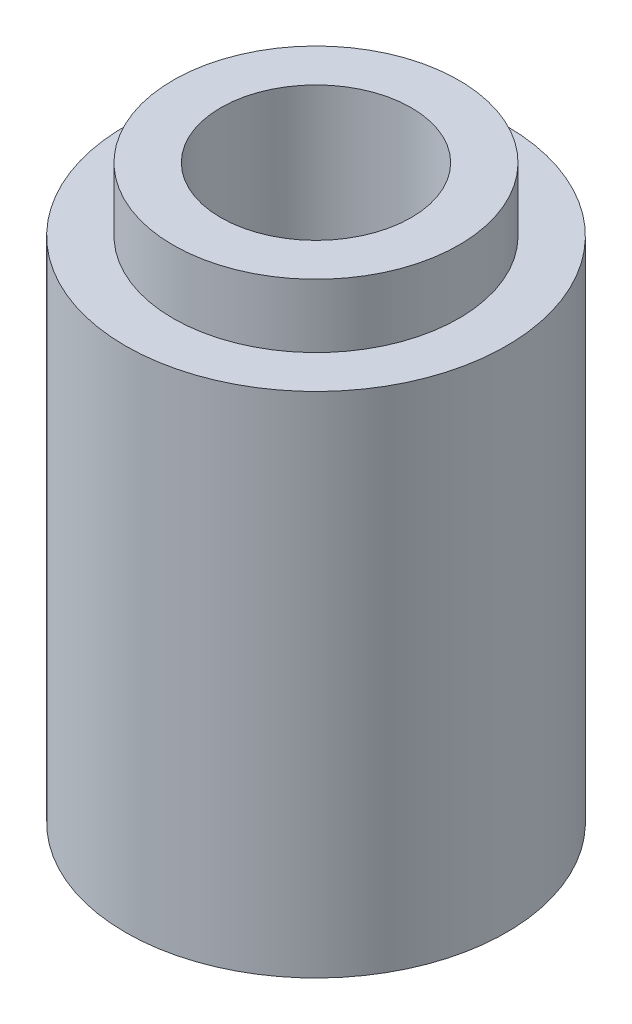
ISO-10303-21;
HEADER;
FILE_DESCRIPTION(('STEP AP214'),'2;1');
FILE_NAME('part.step','',(''),(''),'','','');
FILE_SCHEMA(('AUTOMOTIVE_DESIGN { 1 0 10303 214 1 1 1 1 }'));
ENDSEC;
DATA;
#1=APPLICATION_CONTEXT('core data for automotive mechanical design processes');
#2=APPLICATION_PROTOCOL_DEFINITION('international standard','automotive_design',2000,#1);
#3=PRODUCT_CONTEXT('',#1,'mechanical');
#4=PRODUCT('Part','Part','',(#3));
#5=PRODUCT_RELATED_PRODUCT_CATEGORY('part','',(#4));
#6=PRODUCT_DEFINITION_FORMATION('','',#4);
#7=PRODUCT_DEFINITION_CONTEXT('part definition',#1,'design');
#8=PRODUCT_DEFINITION('design','',#6,#7);
#9=PRODUCT_DEFINITION_SHAPE('','',#8);
#10=(LENGTH_UNIT() NAMED_UNIT(*) SI_UNIT(.MILLI.,.METRE.));
#11=(NAMED_UNIT(*) PLANE_ANGLE_UNIT() SI_UNIT($,.RADIAN.));
#12=(NAMED_UNIT(*) SI_UNIT($,.STERADIAN.) SOLID_ANGLE_UNIT());
#13=UNCERTAINTY_MEASURE_WITH_UNIT(LENGTH_MEASURE(1.E-05),#10,'distance_accuracy_value','');
#14=(GEOMETRIC_REPRESENTATION_CONTEXT(3) GLOBAL_UNCERTAINTY_ASSIGNED_CONTEXT((#13)) GLOBAL_UNIT_ASSIGNED_CONTEXT((#10,
#11,#12)) REPRESENTATION_CONTEXT('',''));
#15=CARTESIAN_POINT('',(0.,0.,0.));
#16=DIRECTION('',(0.,0.,1.));
#17=DIRECTION('',(1.,0.,0.));
#18=AXIS2_PLACEMENT_3D('',#15,#16,#17);
#19=CARTESIAN_POINT('',(0.,8.,0.));
#20=DIRECTION('',(0.,1.,0.));
#21=DIRECTION('',(0.,0.,1.));
#22=AXIS2_PLACEMENT_3D('',#19,#20,#21);
#23=PLANE('',#22);
#24=CARTESIAN_POINT('',(0.,8.,0.));
#25=DIRECTION('',(0.,1.,0.));
#26=DIRECTION('',(0.,0.,1.));
#27=AXIS2_PLACEMENT_3D('',#24,#25,#26);
#28=CIRCLE('',#27,3.);
#29=CARTESIAN_POINT('',(0.,8.,3.));
#30=VERTEX_POINT('',#29);
#31=EDGE_CURVE('E10',#30,#30,#28,.T.);
#32=ORIENTED_EDGE('',*,*,#31,.T.);
#33=EDGE_LOOP('',(#32));
#34=FACE_BOUND('',#33,.T.);
#35=CARTESIAN_POINT('',(0.,8.,0.));
#36=DIRECTION('',(0.,1.,0.));
#37=DIRECTION('',(0.,0.,1.));
#38=AXIS2_PLACEMENT_3D('',#35,#36,#37);
#39=CIRCLE('',#38,2.25);
#40=CARTESIAN_POINT('',(0.,8.,2.25));
#41=VERTEX_POINT('',#40);
#42=EDGE_CURVE('E42',#41,#41,#39,.T.);
#43=ORIENTED_EDGE('',*,*,#42,.F.);
#44=EDGE_LOOP('',(#43));
#45=FACE_BOUND('',#44,.T.);
#46=ADVANCED_FACE('F29',(#34,#45),#23,.T.);
#47=CARTESIAN_POINT('',(0.,8.,0.));
#48=DIRECTION('',(0.,-1.,0.));
#49=DIRECTION('',(0.,0.,-1.));
#50=AXIS2_PLACEMENT_3D('',#47,#48,#49);
#51=CYLINDRICAL_SURFACE('',#50,3.);
#52=ORIENTED_EDGE('',*,*,#31,.F.);
#53=EDGE_LOOP('',(#52));
#54=FACE_BOUND('',#53,.T.);
#55=CARTESIAN_POINT('',(0.,0.,0.));
#56=DIRECTION('',(0.,1.,0.));
#57=DIRECTION('',(0.,0.,1.));
#58=AXIS2_PLACEMENT_3D('',#55,#56,#57);
#59=CIRCLE('',#58,3.);
#60=CARTESIAN_POINT('',(0.,0.,3.));
#61=VERTEX_POINT('',#60);
#62=EDGE_CURVE('E33',#61,#61,#59,.T.);
#63=ORIENTED_EDGE('',*,*,#62,.T.);
#64=EDGE_LOOP('',(#63));
#65=FACE_BOUND('',#64,.T.);
#66=ADVANCED_FACE('F31',(#54,#65),#51,.T.);
#67=CARTESIAN_POINT('',(0.,0.,0.));
#68=DIRECTION('',(0.,1.,0.));
#69=DIRECTION('',(0.,0.,1.));
#70=AXIS2_PLACEMENT_3D('',#67,#68,#69);
#71=PLANE('',#70);
#72=CARTESIAN_POINT('',(0.,0.,0.));
#73=DIRECTION('',(0.,-1.,0.));
#74=DIRECTION('',(0.,0.,-1.));
#75=AXIS2_PLACEMENT_3D('',#72,#73,#74);
#76=CIRCLE('',#75,1.5);
#77=CARTESIAN_POINT('',(0.,0.,-1.5));
#78=VERTEX_POINT('',#77);
#79=EDGE_CURVE('E50',#78,#78,#76,.T.);
#80=ORIENTED_EDGE('',*,*,#79,.F.);
#81=EDGE_LOOP('',(#80));
#82=FACE_BOUND('',#81,.T.);
#83=ORIENTED_EDGE('',*,*,#62,.F.);
#84=EDGE_LOOP('',(#83));
#85=FACE_BOUND('',#84,.T.);
#86=ADVANCED_FACE('F57',(#82,#85),#71,.F.);
#87=CARTESIAN_POINT('',(0.,9.,0.));
#88=DIRECTION('',(0.,-1.,0.));
#89=DIRECTION('',(0.,0.,-1.));
#90=AXIS2_PLACEMENT_3D('',#87,#88,#89);
#91=CYLINDRICAL_SURFACE('',#90,2.25);
#92=CARTESIAN_POINT('',(0.,9.,0.));
#93=DIRECTION('',(0.,1.,0.));
#94=DIRECTION('',(0.,0.,1.));
#95=AXIS2_PLACEMENT_3D('',#92,#93,#94);
#96=CIRCLE('',#95,2.25);
#97=CARTESIAN_POINT('',(0.,9.,2.25));
#98=VERTEX_POINT('',#97);
#99=EDGE_CURVE('E40',#98,#98,#96,.T.);
#100=ORIENTED_EDGE('',*,*,#99,.F.);
#101=EDGE_LOOP('',(#100));
#102=FACE_BOUND('',#101,.T.);
#103=ORIENTED_EDGE('',*,*,#42,.T.);
#104=EDGE_LOOP('',(#103));
#105=FACE_BOUND('',#104,.T.);
#106=ADVANCED_FACE('F60',(#102,#105),#91,.T.);
#107=CARTESIAN_POINT('',(0.,9.,0.));
#108=DIRECTION('',(0.,1.,0.));
#109=DIRECTION('',(0.,0.,1.));
#110=AXIS2_PLACEMENT_3D('',#107,#108,#109);
#111=PLANE('',#110);
#112=CARTESIAN_POINT('',(0.,9.,0.));
#113=DIRECTION('',(0.,1.,0.));
#114=DIRECTION('',(0.,0.,1.));
#115=AXIS2_PLACEMENT_3D('',#112,#113,#114);
#116=CIRCLE('',#115,1.5);
#117=CARTESIAN_POINT('',(0.,9.,1.5));
#118=VERTEX_POINT('',#117);
#119=EDGE_CURVE('E45',#118,#118,#116,.F.);
#120=ORIENTED_EDGE('',*,*,#119,.T.);
#121=EDGE_LOOP('',(#120));
#122=FACE_BOUND('',#121,.T.);
#123=ORIENTED_EDGE('',*,*,#99,.T.);
#124=EDGE_LOOP('',(#123));
#125=FACE_BOUND('',#124,.T.);
#126=ADVANCED_FACE('F75',(#122,#125),#111,.T.);
#127=CARTESIAN_POINT('',(0.,13.2426406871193,0.));
#128=DIRECTION('',(0.,-1.,0.));
#129=DIRECTION('',(0.,0.,-1.));
#130=AXIS2_PLACEMENT_3D('',#127,#128,#129);
#131=CYLINDRICAL_SURFACE('',#130,1.5);
#132=ORIENTED_EDGE('',*,*,#79,.T.);
#133=EDGE_LOOP('',(#132));
#134=FACE_BOUND('',#133,.T.);
#135=ORIENTED_EDGE('',*,*,#119,.F.);
#136=EDGE_LOOP('',(#135));
#137=FACE_BOUND('',#136,.T.);
#138=ADVANCED_FACE('F54',(#134,#137),#131,.F.);
#139=CLOSED_SHELL('',(#46,#66,#86,#106,#126,#138));
#140=MANIFOLD_SOLID_BREP('B2',#139);
#141=ADVANCED_BREP_SHAPE_REPRESENTATION('',(#18,#140),#14);
#142=SHAPE_DEFINITION_REPRESENTATION(#9,#141);
ENDSEC;
END-ISO-10303-21;
